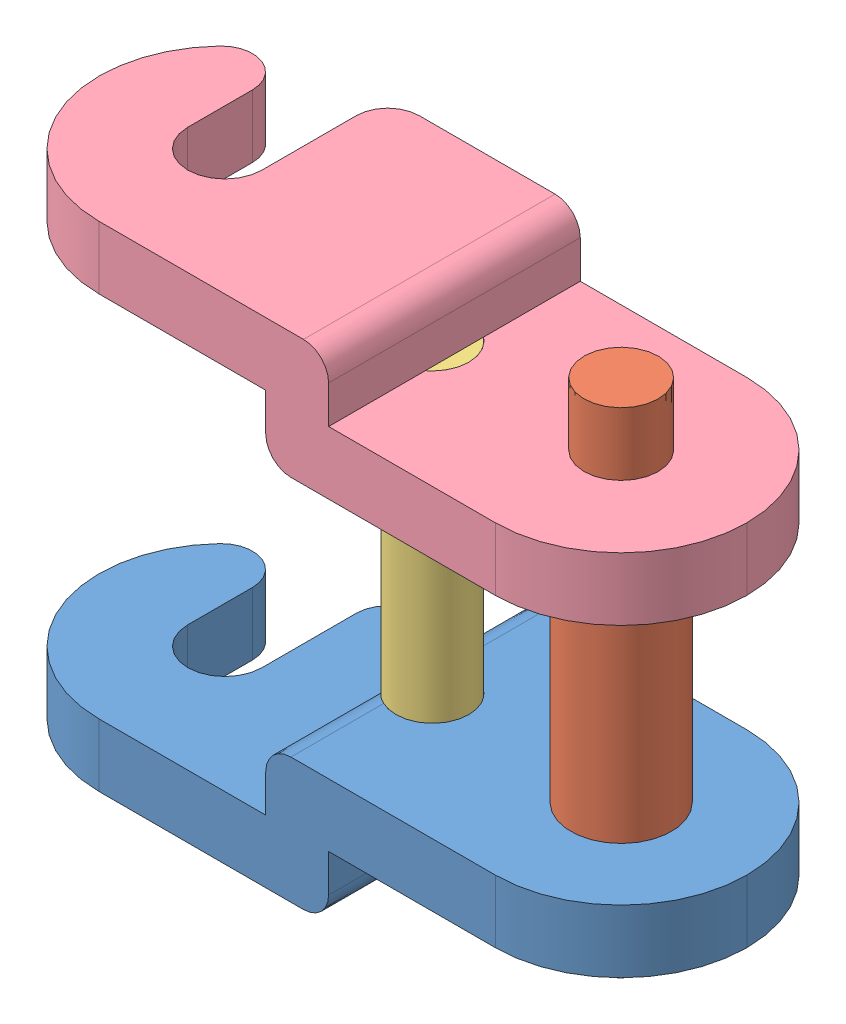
SolidWorks assembly Assem1.sldasm, configuration Default (file format 4400). Lengths in mm.
Overall size (10.3 7.85 4).
4 component instances, 4 part files, 7 mates.
Components (placement in the parent):
- Link Rechts-1: Link Rechts.SLDPRT [Default] at origin size (10.3 2 4)
- Chain As 1-1: Chain As 1.SLDPRT [Default] at (3.15 2 0) x (-0.521599 0 0.853191) z (-0.853191 0 -0.521599) size (1.6 7.85 1.6)
- Chain As 2-1: Chain As 2.SLDPRT [Default] at (0.15 1 0) size (1.16 5.85 1.16)
- Link Links-1: Link Links.SLDPRT [Default] at (0 7.85 0) x (1 0 0) z (0 0 -1) size (10.3 2 4)
Mates (geometry in assembly coordinates):
- Concentric1: concentric anti-aligned: cylinder of Link Rechts-1 through (0.15 1 0) axis (0 1 0) radius 0.58; cylinder of Chain As 2-1 through (0.15 6.85 0) axis (0 -1 0) radius 0.58
- Concentric2: concentric aligned: cylinder of Link Rechts-1 through (3.15 -8 0) axis (0 1 0) radius 0.59; cylinder of Chain As 1-1 through (3.15 0 0) axis (0 1 0) radius 0.59
- Coincident1: coincident anti-aligned: plane of Link Rechts-1 through (-5.15 2 -2) normal (0 1 0); plane of Chain As 1-1 through (3.15 2 0) normal (0 -1 0)
- Coincident2: coincident aligned: plane of Link Rechts-1 through (3.15 1 0) normal (0 -1 0); plane of Chain As 2-1 through (0.15 1 0) normal (0 -1 0)
- Concentric3: concentric anti-aligned: cylinder of Chain As 1-1 through (3.15 7.85 0) axis (0 -1 0) radius 0.59; cylinder of Link Links-1 through (3.15 5.85 0) axis (0 1 0) radius 0.59
- Concentric4: concentric anti-aligned: cylinder of Chain As 2-1 through (0.15 6.85 0) axis (0 -1 0) radius 0.58; cylinder of Link Links-1 through (0.15 -14.15 0) axis (0 1 0) radius 0.58
- Coincident3: coincident anti-aligned: plane of Chain As 1-1 through (3.15 5.85 0) normal (0 1 0); plane of Link Links-1 through (-5.15 5.85 2) normal (0 -1 0)
